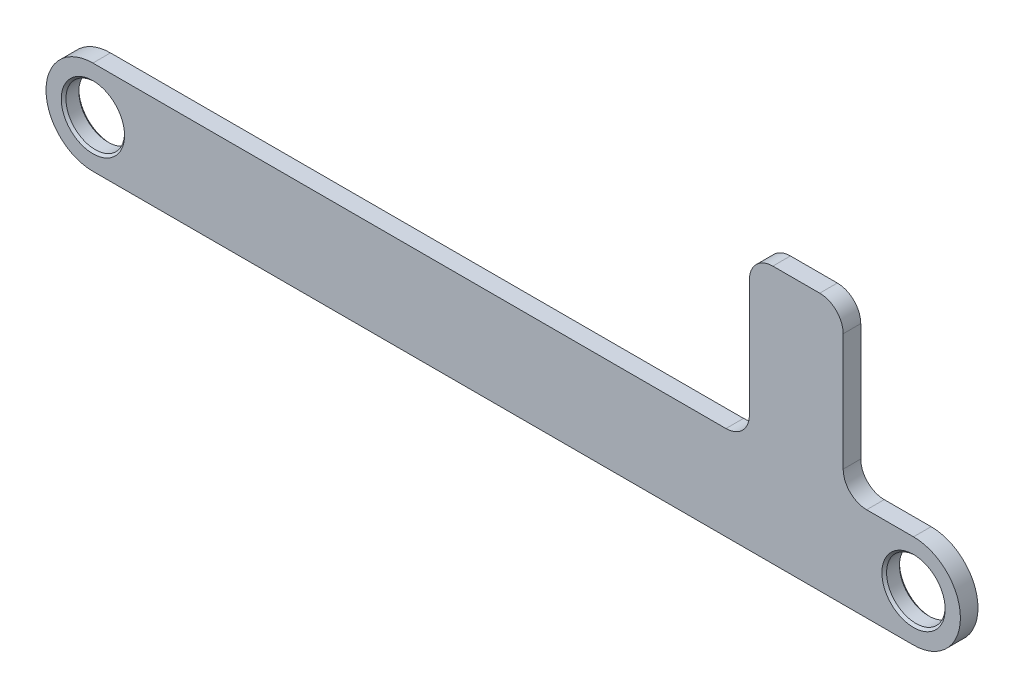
from build123d import *

# Parameters (mm, degrees)
ESQUISSE1_R      = 2.5
EXTRUSION1_DEPTH = 0.75
CONG_1_R         = 2
CHANFREIN1_SIZE  = 0.2


with BuildPart() as part:
    # Esquisse1 → Extrusion1 (new, symmetric)
    with BuildSketch(Plane.XY):
        with BuildLine():
            Line((-70, 4), (-14, 4))
            Line((-14, 4), (-14, 18))
            Line((-14, 18), (-6, 18))
            Line((-6, 18), (-6, 4))
            Line((-6, 4), (0, 4))
            ThreePointArc((0, 4), (4, 0), (0, -4))
            Line((0, -4), (-70, -4))
            ThreePointArc((-70, -4), (-74, 0), (-70, 4))
        make_face()
        with Locations((-70, 0)):
            Circle(ESQUISSE1_R, mode=Mode.SUBTRACT)
        Circle(ESQUISSE1_R, mode=Mode.SUBTRACT)
    extrude(amount=EXTRUSION1_DEPTH, both=True)

    # Cong_1
    cong_1_edges = [part.edges().sort_by_distance(p)[0] for p in [
        (-14, 4, 0),
        (-14, 18, 0),
        (-6, 18, 0),
        (-6, 4, 0),
    ]]
    fillet(cong_1_edges, radius=CONG_1_R)

    # Chanfrein1
    chanfrein1_edges = [part.edges().sort_by_distance(p)[0] for p in [
        (-72.5, 0, -0.75),
        (-72.5, 0, 0.75),
        (-2.5, 0, -0.75),
        (-2.5, 0, 0.75),
    ]]
    chamfer(chanfrein1_edges, length=CHANFREIN1_SIZE)


solid = part.part
